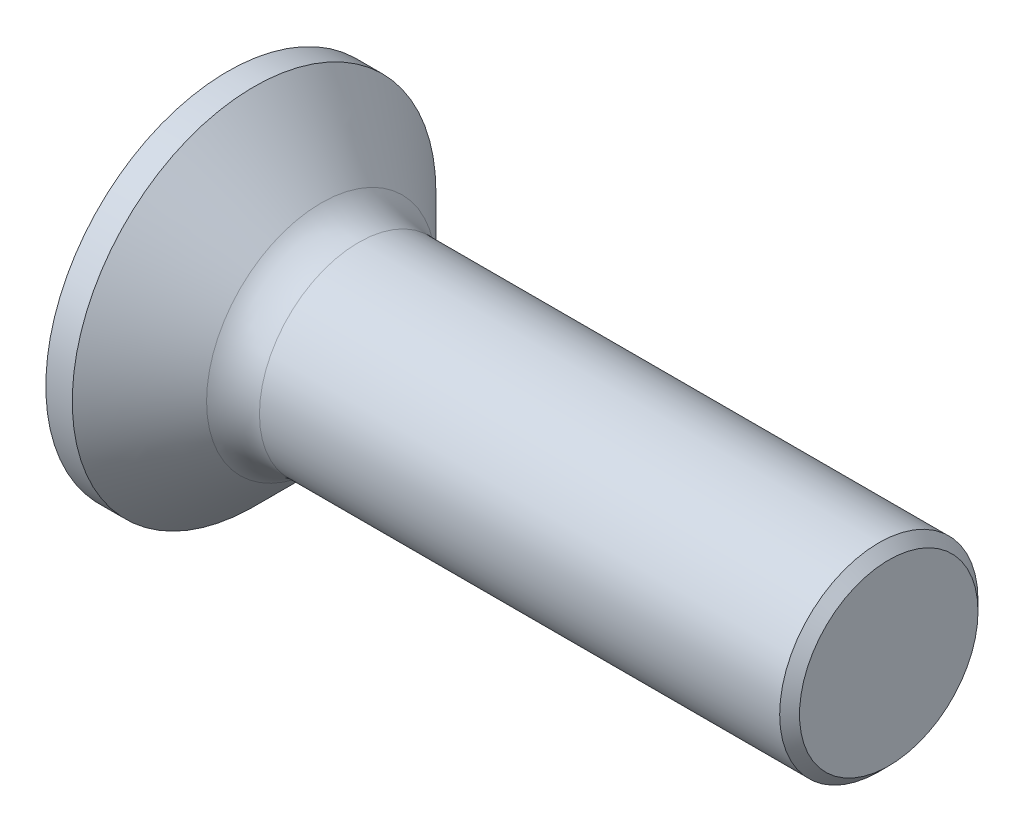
ISO-10303-21;
HEADER;
FILE_DESCRIPTION(('STEP AP214'),'2;1');
FILE_NAME('part.step','',(''),(''),'','','');
FILE_SCHEMA(('AUTOMOTIVE_DESIGN { 1 0 10303 214 1 1 1 1 }'));
ENDSEC;
DATA;
#1=APPLICATION_CONTEXT('core data for automotive mechanical design processes');
#2=APPLICATION_PROTOCOL_DEFINITION('international standard','automotive_design',2000,#1);
#3=PRODUCT_CONTEXT('',#1,'mechanical');
#4=PRODUCT('Part','Part','',(#3));
#5=PRODUCT_RELATED_PRODUCT_CATEGORY('part','',(#4));
#6=PRODUCT_DEFINITION_FORMATION('','',#4);
#7=PRODUCT_DEFINITION_CONTEXT('part definition',#1,'design');
#8=PRODUCT_DEFINITION('design','',#6,#7);
#9=PRODUCT_DEFINITION_SHAPE('','',#8);
#10=(LENGTH_UNIT() NAMED_UNIT(*) SI_UNIT(.MILLI.,.METRE.));
#11=(NAMED_UNIT(*) PLANE_ANGLE_UNIT() SI_UNIT($,.RADIAN.));
#12=(NAMED_UNIT(*) SI_UNIT($,.STERADIAN.) SOLID_ANGLE_UNIT());
#13=UNCERTAINTY_MEASURE_WITH_UNIT(LENGTH_MEASURE(1.E-05),#10,'distance_accuracy_value','');
#14=(GEOMETRIC_REPRESENTATION_CONTEXT(3) GLOBAL_UNCERTAINTY_ASSIGNED_CONTEXT((#13)) GLOBAL_UNIT_ASSIGNED_CONTEXT((#10,
#11,#12)) REPRESENTATION_CONTEXT('',''));
#15=CARTESIAN_POINT('',(0.,0.,0.));
#16=DIRECTION('',(0.,0.,1.));
#17=DIRECTION('',(1.,0.,0.));
#18=AXIS2_PLACEMENT_3D('',#15,#16,#17);
#19=CARTESIAN_POINT('',(0.2,0.,0.));
#20=DIRECTION('',(-1.,0.,0.));
#21=DIRECTION('',(0.,0.,1.));
#22=AXIS2_PLACEMENT_3D('',#19,#20,#21);
#23=CYLINDRICAL_SURFACE('',#22,2.75);
#24=CARTESIAN_POINT('',(0.4,0.,0.));
#25=DIRECTION('',(-1.,0.,0.));
#26=DIRECTION('',(0.,0.,-1.));
#27=AXIS2_PLACEMENT_3D('',#24,#25,#26);
#28=CIRCLE('',#27,2.75);
#29=CARTESIAN_POINT('',(0.4,0.,-2.75));
#30=VERTEX_POINT('',#29);
#31=EDGE_CURVE('E373',#30,#30,#28,.T.);
#32=ORIENTED_EDGE('',*,*,#31,.T.);
#33=EDGE_LOOP('',(#32));
#34=FACE_BOUND('',#33,.T.);
#35=CARTESIAN_POINT('',(0.,0.,0.));
#36=DIRECTION('',(-1.,0.,0.));
#37=DIRECTION('',(0.,0.,-1.));
#38=AXIS2_PLACEMENT_3D('',#35,#36,#37);
#39=CIRCLE('',#38,2.75);
#40=CARTESIAN_POINT('',(0.,0.,-2.75));
#41=VERTEX_POINT('',#40);
#42=EDGE_CURVE('E376',#41,#41,#39,.T.);
#43=ORIENTED_EDGE('',*,*,#42,.F.);
#44=EDGE_LOOP('',(#43));
#45=FACE_BOUND('',#44,.T.);
#46=ADVANCED_FACE('F17',(#34,#45),#23,.T.);
#47=DIRECTION('',(0.707106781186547,0.,0.707106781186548));
#48=VECTOR('',#47,1.);
#49=CARTESIAN_POINT('',(-498996.85,-1.22215714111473E-10,-499000.));
#50=LINE('',#49,#48);
#51=CARTESIAN_POINT('',(3.15,0.,0.));
#52=DIRECTION('',(-1.,0.,0.));
#53=AXIS1_PLACEMENT('',#51,#52);
#54=SURFACE_OF_REVOLUTION('',#50,#53);
#55=CARTESIAN_POINT('',(1.41568542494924,0.,0.));
#56=DIRECTION('',(-1.,0.,0.));
#57=DIRECTION('',(0.,0.,-1.));
#58=AXIS2_PLACEMENT_3D('',#55,#56,#57);
#59=CIRCLE('',#58,1.73431457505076);
#60=CARTESIAN_POINT('',(1.41568542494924,0.,-1.73431457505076));
#61=VERTEX_POINT('',#60);
#62=EDGE_CURVE('E11',#61,#61,#59,.T.);
#63=ORIENTED_EDGE('',*,*,#62,.T.);
#64=EDGE_LOOP('',(#63));
#65=FACE_BOUND('',#64,.T.);
#66=ORIENTED_EDGE('',*,*,#31,.F.);
#67=EDGE_LOOP('',(#66));
#68=FACE_BOUND('',#67,.T.);
#69=ADVANCED_FACE('F233',(#65,#68),#54,.F.);
#70=CARTESIAN_POINT('',(1.98137084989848,0.,0.));
#71=DIRECTION('',(-1.,0.,0.));
#72=DIRECTION('',(0.,0.,1.));
#73=AXIS2_PLACEMENT_3D('',#70,#71,#72);
#74=TOROIDAL_SURFACE('',#73,2.3,0.8);
#75=CARTESIAN_POINT('',(1.98137084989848,0.,0.));
#76=DIRECTION('',(-1.,0.,0.));
#77=DIRECTION('',(0.,0.,-1.));
#78=AXIS2_PLACEMENT_3D('',#75,#76,#77);
#79=CIRCLE('',#78,1.5);
#80=CARTESIAN_POINT('',(1.98137084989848,0.,-1.5));
#81=VERTEX_POINT('',#80);
#82=EDGE_CURVE('E27',#81,#81,#79,.T.);
#83=ORIENTED_EDGE('',*,*,#82,.T.);
#84=EDGE_LOOP('',(#83));
#85=FACE_BOUND('',#84,.T.);
#86=ORIENTED_EDGE('',*,*,#62,.F.);
#87=EDGE_LOOP('',(#86));
#88=FACE_BOUND('',#87,.T.);
#89=ADVANCED_FACE('F237',(#85,#88),#74,.F.);
#90=CARTESIAN_POINT('',(5.91568542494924,0.,0.));
#91=DIRECTION('',(-1.,0.,0.));
#92=DIRECTION('',(0.,0.,1.));
#93=AXIS2_PLACEMENT_3D('',#90,#91,#92);
#94=CYLINDRICAL_SURFACE('',#93,1.5);
#95=CARTESIAN_POINT('',(9.85,0.,0.));
#96=DIRECTION('',(-1.,0.,0.));
#97=DIRECTION('',(0.,0.,-1.));
#98=AXIS2_PLACEMENT_3D('',#95,#96,#97);
#99=CIRCLE('',#98,1.5);
#100=CARTESIAN_POINT('',(9.85,0.,-1.5));
#101=VERTEX_POINT('',#100);
#102=EDGE_CURVE('E408',#101,#101,#99,.T.);
#103=ORIENTED_EDGE('',*,*,#102,.T.);
#104=EDGE_LOOP('',(#103));
#105=FACE_BOUND('',#104,.T.);
#106=ORIENTED_EDGE('',*,*,#82,.F.);
#107=EDGE_LOOP('',(#106));
#108=FACE_BOUND('',#107,.T.);
#109=ADVANCED_FACE('F241',(#105,#108),#94,.T.);
#110=DIRECTION('',(0.707106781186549,0.,0.707106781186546));
#111=VECTOR('',#110,1.);
#112=CARTESIAN_POINT('',(-498988.650000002,-1.22215714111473E-10,-499000.));
#113=LINE('',#112,#111);
#114=CARTESIAN_POINT('',(11.35,0.,0.));
#115=DIRECTION('',(-1.,0.,0.));
#116=AXIS1_PLACEMENT('',#114,#115);
#117=SURFACE_OF_REVOLUTION('',#113,#116);
#118=CARTESIAN_POINT('',(10.,0.,0.));
#119=DIRECTION('',(-1.,0.,0.));
#120=DIRECTION('',(0.,0.,-1.));
#121=AXIS2_PLACEMENT_3D('',#118,#119,#120);
#122=CIRCLE('',#121,1.35);
#123=CARTESIAN_POINT('',(10.,0.,-1.35));
#124=VERTEX_POINT('',#123);
#125=EDGE_CURVE('E411',#124,#124,#122,.T.);
#126=ORIENTED_EDGE('',*,*,#125,.T.);
#127=EDGE_LOOP('',(#126));
#128=FACE_BOUND('',#127,.T.);
#129=ORIENTED_EDGE('',*,*,#102,.F.);
#130=EDGE_LOOP('',(#129));
#131=FACE_BOUND('',#130,.T.);
#132=ADVANCED_FACE('F245',(#128,#131),#117,.F.);
#133=CARTESIAN_POINT('',(10.,0.,-0.674999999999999));
#134=DIRECTION('',(1.,0.,0.));
#135=DIRECTION('',(0.,1.,0.));
#136=AXIS2_PLACEMENT_3D('',#133,#134,#135);
#137=PLANE('',#136);
#138=ORIENTED_EDGE('',*,*,#125,.F.);
#139=EDGE_LOOP('',(#138));
#140=FACE_BOUND('',#139,.T.);
#141=ADVANCED_FACE('F249',(#140),#137,.T.);
#142=CARTESIAN_POINT('',(-1.,-1.7,0.425));
#143=DIRECTION('',(0.,1.,0.));
#144=DIRECTION('',(0.,0.,1.));
#145=AXIS2_PLACEMENT_3D('',#142,#143,#144);
#146=PLANE('',#145);
#147=DIRECTION('',(0.,0.,-1.));
#148=VECTOR('',#147,1.);
#149=CARTESIAN_POINT('',(0.,-1.7,-0.475));
#150=LINE('',#149,#148);
#151=CARTESIAN_POINT('',(0.,-1.7,0.425));
#152=VERTEX_POINT('',#151);
#153=CARTESIAN_POINT('',(0.,-1.7,-0.425));
#154=VERTEX_POINT('',#153);
#155=EDGE_CURVE('E36',#152,#154,#150,.T.);
#156=ORIENTED_EDGE('',*,*,#155,.F.);
#157=DIRECTION('',(1.,0.,0.));
#158=VECTOR('',#157,1.);
#159=CARTESIAN_POINT('',(-1.,-1.7,0.425));
#160=LINE('',#159,#158);
#161=CARTESIAN_POINT('',(0.825,-1.7,0.425));
#162=VERTEX_POINT('',#161);
#163=EDGE_CURVE('E457',#152,#162,#160,.T.);
#164=ORIENTED_EDGE('',*,*,#163,.T.);
#165=DIRECTION('',(0.,0.,-1.));
#166=VECTOR('',#165,1.);
#167=CARTESIAN_POINT('',(0.825,-1.7,0.425));
#168=LINE('',#167,#166);
#169=CARTESIAN_POINT('',(0.825,-1.7,-0.425));
#170=VERTEX_POINT('',#169);
#171=EDGE_CURVE('E415',#162,#170,#168,.T.);
#172=ORIENTED_EDGE('',*,*,#171,.T.);
#173=DIRECTION('',(1.,0.,0.));
#174=VECTOR('',#173,1.);
#175=CARTESIAN_POINT('',(-1.,-1.7,-0.425));
#176=LINE('',#175,#174);
#177=EDGE_CURVE('E477',#154,#170,#176,.T.);
#178=ORIENTED_EDGE('',*,*,#177,.F.);
#179=EDGE_LOOP('',(#156,#164,#172,#178));
#180=FACE_BOUND('',#179,.T.);
#181=ADVANCED_FACE('F253',(#180),#146,.T.);
#182=CARTESIAN_POINT('',(2.5245,0.425,0.425));
#183=DIRECTION('',(-0.600112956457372,-0.799915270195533,0.));
#184=DIRECTION('',(0.799915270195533,-0.600112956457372,0.));
#185=AXIS2_PLACEMENT_3D('',#182,#183,#184);
#186=PLANE('',#185);
#187=DIRECTION('',(-0.799915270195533,0.600112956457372,0.));
#188=VECTOR('',#187,1.);
#189=CARTESIAN_POINT('',(2.5245,0.425,-0.425));
#190=LINE('',#189,#188);
#191=CARTESIAN_POINT('',(2.5245,0.425,-0.425));
#192=VERTEX_POINT('',#191);
#193=CARTESIAN_POINT('',(0.825,1.7,-0.425));
#194=VERTEX_POINT('',#193);
#195=EDGE_CURVE('E422',#192,#194,#190,.T.);
#196=ORIENTED_EDGE('',*,*,#195,.F.);
#197=DIRECTION('',(0.,0.,-1.));
#198=VECTOR('',#197,1.);
#199=CARTESIAN_POINT('',(2.5245,0.425,0.425));
#200=LINE('',#199,#198);
#201=CARTESIAN_POINT('',(2.5245,0.425,0.425));
#202=VERTEX_POINT('',#201);
#203=EDGE_CURVE('E483',#202,#192,#200,.T.);
#204=ORIENTED_EDGE('',*,*,#203,.F.);
#205=DIRECTION('',(-0.799915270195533,0.600112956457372,0.));
#206=VECTOR('',#205,1.);
#207=CARTESIAN_POINT('',(2.5245,0.425,0.425));
#208=LINE('',#207,#206);
#209=CARTESIAN_POINT('',(0.825,1.7,0.425));
#210=VERTEX_POINT('',#209);
#211=EDGE_CURVE('E412',#202,#210,#208,.T.);
#212=ORIENTED_EDGE('',*,*,#211,.T.);
#213=DIRECTION('',(0.,0.,-1.));
#214=VECTOR('',#213,1.);
#215=CARTESIAN_POINT('',(0.825,1.7,0.425));
#216=LINE('',#215,#214);
#217=EDGE_CURVE('E416',#210,#194,#216,.T.);
#218=ORIENTED_EDGE('',*,*,#217,.T.);
#219=EDGE_LOOP('',(#196,#204,#212,#218));
#220=FACE_BOUND('',#219,.T.);
#221=ADVANCED_FACE('F257',(#220),#186,.T.);
#222=CARTESIAN_POINT('',(2.5245,-0.425,0.425));
#223=DIRECTION('',(-1.,0.,0.));
#224=DIRECTION('',(0.,0.,1.));
#225=AXIS2_PLACEMENT_3D('',#222,#223,#224);
#226=PLANE('',#225);
#227=DIRECTION('',(0.,0.,-1.));
#228=VECTOR('',#227,1.);
#229=CARTESIAN_POINT('',(2.5245,-0.419753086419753,0.2125));
#230=LINE('',#229,#228);
#231=CARTESIAN_POINT('',(2.5245,-0.419753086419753,0.425));
#232=VERTEX_POINT('',#231);
#233=CARTESIAN_POINT('',(2.5245,-0.419753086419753,-0.425));
#234=VERTEX_POINT('',#233);
#235=EDGE_CURVE('E219',#232,#234,#230,.T.);
#236=ORIENTED_EDGE('',*,*,#235,.T.);
#237=DIRECTION('',(0.,1.,0.));
#238=VECTOR('',#237,1.);
#239=CARTESIAN_POINT('',(2.5245,-0.425,-0.425));
#240=LINE('',#239,#238);
#241=CARTESIAN_POINT('',(2.5245,-0.425,-0.425));
#242=VERTEX_POINT('',#241);
#243=EDGE_CURVE('E511',#242,#234,#240,.T.);
#244=ORIENTED_EDGE('',*,*,#243,.F.);
#245=DIRECTION('',(0.,0.,-1.));
#246=VECTOR('',#245,1.);
#247=CARTESIAN_POINT('',(2.5245,-0.425,0.425));
#248=LINE('',#247,#246);
#249=CARTESIAN_POINT('',(2.5245,-0.425,0.425));
#250=VERTEX_POINT('',#249);
#251=EDGE_CURVE('E435',#250,#242,#248,.T.);
#252=ORIENTED_EDGE('',*,*,#251,.F.);
#253=DIRECTION('',(0.,1.,0.));
#254=VECTOR('',#253,1.);
#255=CARTESIAN_POINT('',(2.5245,-0.425,0.425));
#256=LINE('',#255,#254);
#257=EDGE_CURVE('E458',#250,#232,#256,.T.);
#258=ORIENTED_EDGE('',*,*,#257,.T.);
#259=EDGE_LOOP('',(#236,#244,#252,#258));
#260=FACE_BOUND('',#259,.T.);
#261=ADVANCED_FACE('F260',(#260),#226,.T.);
#262=CARTESIAN_POINT('',(0.825,-1.7,0.425));
#263=DIRECTION('',(-0.600112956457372,0.799915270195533,0.));
#264=DIRECTION('',(-0.799915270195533,-0.600112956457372,0.));
#265=AXIS2_PLACEMENT_3D('',#262,#263,#264);
#266=PLANE('',#265);
#267=DIRECTION('',(0.799915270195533,0.600112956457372,0.));
#268=VECTOR('',#267,1.);
#269=CARTESIAN_POINT('',(0.825,-1.7,-0.425));
#270=LINE('',#269,#268);
#271=EDGE_CURVE('E480',#170,#242,#270,.T.);
#272=ORIENTED_EDGE('',*,*,#271,.F.);
#273=ORIENTED_EDGE('',*,*,#171,.F.);
#274=DIRECTION('',(0.799915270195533,0.600112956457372,0.));
#275=VECTOR('',#274,1.);
#276=CARTESIAN_POINT('',(0.825,-1.7,0.425));
#277=LINE('',#276,#275);
#278=EDGE_CURVE('E461',#162,#250,#277,.T.);
#279=ORIENTED_EDGE('',*,*,#278,.T.);
#280=ORIENTED_EDGE('',*,*,#251,.T.);
#281=EDGE_LOOP('',(#272,#273,#279,#280));
#282=FACE_BOUND('',#281,.T.);
#283=ADVANCED_FACE('F264',(#282),#266,.T.);
#284=CARTESIAN_POINT('',(0.825,1.7,0.425));
#285=DIRECTION('',(0.,-1.,0.));
#286=DIRECTION('',(0.,0.,-1.));
#287=AXIS2_PLACEMENT_3D('',#284,#285,#286);
#288=PLANE('',#287);
#289=DIRECTION('',(0.,0.,1.));
#290=VECTOR('',#289,1.);
#291=CARTESIAN_POINT('',(0.,1.7,-0.475));
#292=LINE('',#291,#290);
#293=CARTESIAN_POINT('',(0.,1.7,-0.425));
#294=VERTEX_POINT('',#293);
#295=CARTESIAN_POINT('',(0.,1.7,0.425));
#296=VERTEX_POINT('',#295);
#297=EDGE_CURVE('E389',#294,#296,#292,.T.);
#298=ORIENTED_EDGE('',*,*,#297,.F.);
#299=DIRECTION('',(-1.,0.,0.));
#300=VECTOR('',#299,1.);
#301=CARTESIAN_POINT('',(0.825,1.7,-0.425));
#302=LINE('',#301,#300);
#303=EDGE_CURVE('E425',#194,#294,#302,.T.);
#304=ORIENTED_EDGE('',*,*,#303,.F.);
#305=ORIENTED_EDGE('',*,*,#217,.F.);
#306=DIRECTION('',(-1.,0.,0.));
#307=VECTOR('',#306,1.);
#308=CARTESIAN_POINT('',(0.825,1.7,0.425));
#309=LINE('',#308,#307);
#310=EDGE_CURVE('E432',#210,#296,#309,.T.);
#311=ORIENTED_EDGE('',*,*,#310,.T.);
#312=EDGE_LOOP('',(#298,#304,#305,#311));
#313=FACE_BOUND('',#312,.T.);
#314=ADVANCED_FACE('F268',(#313),#288,.T.);
#315=CARTESIAN_POINT('',(0.,0.,0.425));
#316=DIRECTION('',(0.,0.,-1.));
#317=DIRECTION('',(-1.,0.,0.));
#318=AXIS2_PLACEMENT_3D('',#315,#316,#317);
#319=PLANE('',#318);
#320=DIRECTION('',(-1.,0.,0.));
#321=VECTOR('',#320,1.);
#322=CARTESIAN_POINT('',(0.,0.55003270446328,0.425));
#323=LINE('',#322,#321);
#324=CARTESIAN_POINT('',(1.,0.55003270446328,0.425));
#325=VERTEX_POINT('',#324);
#326=CARTESIAN_POINT('',(0.,0.55003270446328,0.425));
#327=VERTEX_POINT('',#326);
#328=EDGE_CURVE('E436',#325,#327,#323,.T.);
#329=ORIENTED_EDGE('',*,*,#328,.T.);
#330=DIRECTION('',(0.,-1.,0.));
#331=VECTOR('',#330,1.);
#332=CARTESIAN_POINT('',(0.,0.,0.425));
#333=LINE('',#332,#331);
#334=EDGE_CURVE('E391',#296,#327,#333,.T.);
#335=ORIENTED_EDGE('',*,*,#334,.F.);
#336=ORIENTED_EDGE('',*,*,#310,.F.);
#337=ORIENTED_EDGE('',*,*,#211,.F.);
#338=DIRECTION('',(0.,1.,0.));
#339=VECTOR('',#338,1.);
#340=CARTESIAN_POINT('',(2.5245,-0.425,0.425));
#341=LINE('',#340,#339);
#342=CARTESIAN_POINT('',(2.5245,0.419753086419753,0.425));
#343=VERTEX_POINT('',#342);
#344=EDGE_CURVE('E495',#343,#202,#341,.T.);
#345=ORIENTED_EDGE('',*,*,#344,.F.);
#346=DIRECTION('',(-1.,0.,0.));
#347=VECTOR('',#346,1.);
#348=CARTESIAN_POINT('',(0.,0.419753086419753,0.425));
#349=LINE('',#348,#347);
#350=CARTESIAN_POINT('',(1.,0.419753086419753,0.425));
#351=VERTEX_POINT('',#350);
#352=EDGE_CURVE('E470',#343,#351,#349,.T.);
#353=ORIENTED_EDGE('',*,*,#352,.T.);
#354=DIRECTION('',(0.,1.,0.));
#355=VECTOR('',#354,1.);
#356=CARTESIAN_POINT('',(1.,0.,0.425));
#357=LINE('',#356,#355);
#358=EDGE_CURVE('E523',#351,#325,#357,.T.);
#359=ORIENTED_EDGE('',*,*,#358,.T.);
#360=EDGE_LOOP('',(#329,#335,#336,#337,#345,#353,#359));
#361=FACE_BOUND('',#360,.T.);
#362=ADVANCED_FACE('F272',(#361),#319,.T.);
#363=CARTESIAN_POINT('',(2.5245,-0.425,0.425));
#364=DIRECTION('',(-1.,0.,0.));
#365=DIRECTION('',(0.,0.,1.));
#366=AXIS2_PLACEMENT_3D('',#363,#364,#365);
#367=PLANE('',#366);
#368=DIRECTION('',(0.,0.,1.));
#369=VECTOR('',#368,1.);
#370=CARTESIAN_POINT('',(2.5245,0.419753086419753,0.2125));
#371=LINE('',#370,#369);
#372=CARTESIAN_POINT('',(2.5245,0.419753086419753,-0.425));
#373=VERTEX_POINT('',#372);
#374=EDGE_CURVE('E497',#373,#343,#371,.T.);
#375=ORIENTED_EDGE('',*,*,#374,.T.);
#376=ORIENTED_EDGE('',*,*,#344,.T.);
#377=ORIENTED_EDGE('',*,*,#203,.T.);
#378=DIRECTION('',(0.,1.,0.));
#379=VECTOR('',#378,1.);
#380=CARTESIAN_POINT('',(2.5245,-0.425,-0.425));
#381=LINE('',#380,#379);
#382=EDGE_CURVE('E424',#373,#192,#381,.T.);
#383=ORIENTED_EDGE('',*,*,#382,.F.);
#384=EDGE_LOOP('',(#375,#376,#377,#383));
#385=FACE_BOUND('',#384,.T.);
#386=ADVANCED_FACE('F276',(#385),#367,.T.);
#387=CARTESIAN_POINT('',(0.,0.,-0.425));
#388=DIRECTION('',(0.,0.,1.));
#389=DIRECTION('',(1.,0.,0.));
#390=AXIS2_PLACEMENT_3D('',#387,#388,#389);
#391=PLANE('',#390);
#392=DIRECTION('',(-1.,0.,0.));
#393=VECTOR('',#392,1.);
#394=CARTESIAN_POINT('',(0.,-0.55003270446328,-0.425));
#395=LINE('',#394,#393);
#396=CARTESIAN_POINT('',(1.,-0.55003270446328,-0.425));
#397=VERTEX_POINT('',#396);
#398=CARTESIAN_POINT('',(0.,-0.55003270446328,-0.425));
#399=VERTEX_POINT('',#398);
#400=EDGE_CURVE('E479',#397,#399,#395,.T.);
#401=ORIENTED_EDGE('',*,*,#400,.T.);
#402=DIRECTION('',(0.,1.,0.));
#403=VECTOR('',#402,1.);
#404=CARTESIAN_POINT('',(0.,0.,-0.425));
#405=LINE('',#404,#403);
#406=EDGE_CURVE('E431',#154,#399,#405,.T.);
#407=ORIENTED_EDGE('',*,*,#406,.F.);
#408=ORIENTED_EDGE('',*,*,#177,.T.);
#409=ORIENTED_EDGE('',*,*,#271,.T.);
#410=ORIENTED_EDGE('',*,*,#243,.T.);
#411=DIRECTION('',(-1.,0.,0.));
#412=VECTOR('',#411,1.);
#413=CARTESIAN_POINT('',(0.,-0.419753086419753,-0.425));
#414=LINE('',#413,#412);
#415=CARTESIAN_POINT('',(1.,-0.419753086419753,-0.425));
#416=VERTEX_POINT('',#415);
#417=EDGE_CURVE('E381',#234,#416,#414,.T.);
#418=ORIENTED_EDGE('',*,*,#417,.T.);
#419=DIRECTION('',(0.,-1.,0.));
#420=VECTOR('',#419,1.);
#421=CARTESIAN_POINT('',(1.,0.,-0.425));
#422=LINE('',#421,#420);
#423=EDGE_CURVE('E377',#416,#397,#422,.T.);
#424=ORIENTED_EDGE('',*,*,#423,.T.);
#425=EDGE_LOOP('',(#401,#407,#408,#409,#410,#418,#424));
#426=FACE_BOUND('',#425,.T.);
#427=ADVANCED_FACE('F280',(#426),#391,.T.);
#428=CARTESIAN_POINT('',(0.,0.,-1.375));
#429=DIRECTION('',(-1.,0.,0.));
#430=DIRECTION('',(0.,0.,1.));
#431=AXIS2_PLACEMENT_3D('',#428,#429,#430);
#432=PLANE('',#431);
#433=ORIENTED_EDGE('',*,*,#42,.T.);
#434=EDGE_LOOP('',(#433));
#435=FACE_BOUND('',#434,.T.);
#436=DIRECTION('',(0.,-0.642787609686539,0.766044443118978));
#437=VECTOR('',#436,1.);
#438=CARTESIAN_POINT('',(0.,0.491985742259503,-0.355822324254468));
#439=LINE('',#438,#437);
#440=CARTESIAN_POINT('',(0.,1.20208152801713,-1.20208152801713));
#441=VERTEX_POINT('',#440);
#442=CARTESIAN_POINT('',(0.,0.55003270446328,-0.425));
#443=VERTEX_POINT('',#442);
#444=EDGE_CURVE('E378',#441,#443,#439,.T.);
#445=ORIENTED_EDGE('',*,*,#444,.T.);
#446=DIRECTION('',(0.,1.,0.));
#447=VECTOR('',#446,1.);
#448=CARTESIAN_POINT('',(0.,0.,-0.425));
#449=LINE('',#448,#447);
#450=EDGE_CURVE('E384',#443,#294,#449,.T.);
#451=ORIENTED_EDGE('',*,*,#450,.T.);
#452=ORIENTED_EDGE('',*,*,#297,.T.);
#453=ORIENTED_EDGE('',*,*,#334,.T.);
#454=DIRECTION('',(0.,0.642787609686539,0.766044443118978));
#455=VECTOR('',#454,1.);
#456=CARTESIAN_POINT('',(0.,0.319263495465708,0.149979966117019));
#457=LINE('',#456,#455);
#458=CARTESIAN_POINT('',(0.,1.20208152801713,1.20208152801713));
#459=VERTEX_POINT('',#458);
#460=EDGE_CURVE('E507',#327,#459,#457,.T.);
#461=ORIENTED_EDGE('',*,*,#460,.T.);
#462=DIRECTION('',(0.,-0.766044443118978,-0.642787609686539));
#463=VECTOR('',#462,1.);
#464=CARTESIAN_POINT('',(0.,-0.386146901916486,-0.130600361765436));
#465=LINE('',#464,#463);
#466=CARTESIAN_POINT('',(0.,0.419753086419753,0.545630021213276));
#467=VERTEX_POINT('',#466);
#468=EDGE_CURVE('E505',#459,#467,#465,.T.);
#469=ORIENTED_EDGE('',*,*,#468,.T.);
#470=DIRECTION('',(0.,0.,1.));
#471=VECTOR('',#470,1.);
#472=CARTESIAN_POINT('',(0.,0.419753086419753,-0.6875));
#473=LINE('',#472,#471);
#474=CARTESIAN_POINT('',(0.,0.419753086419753,1.7));
#475=VERTEX_POINT('',#474);
#476=EDGE_CURVE('E508',#467,#475,#473,.T.);
#477=ORIENTED_EDGE('',*,*,#476,.T.);
#478=DIRECTION('',(0.,-1.,0.));
#479=VECTOR('',#478,1.);
#480=CARTESIAN_POINT('',(0.,0.209876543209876,1.7));
#481=LINE('',#480,#479);
#482=CARTESIAN_POINT('',(0.,-0.419753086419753,1.7));
#483=VERTEX_POINT('',#482);
#484=EDGE_CURVE('E515',#475,#483,#481,.T.);
#485=ORIENTED_EDGE('',*,*,#484,.T.);
#486=DIRECTION('',(0.,0.,-1.));
#487=VECTOR('',#486,1.);
#488=CARTESIAN_POINT('',(0.,-0.419753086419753,-0.6875));
#489=LINE('',#488,#487);
#490=CARTESIAN_POINT('',(0.,-0.419753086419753,0.545630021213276));
#491=VERTEX_POINT('',#490);
#492=EDGE_CURVE('E518',#483,#491,#489,.T.);
#493=ORIENTED_EDGE('',*,*,#492,.T.);
#494=DIRECTION('',(0.,-0.766044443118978,0.642787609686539));
#495=VECTOR('',#494,1.);
#496=CARTESIAN_POINT('',(0.,-0.214893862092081,0.373732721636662));
#497=LINE('',#496,#495);
#498=CARTESIAN_POINT('',(0.,-1.20208152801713,1.20208152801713));
#499=VERTEX_POINT('',#498);
#500=EDGE_CURVE('E532',#491,#499,#497,.T.);
#501=ORIENTED_EDGE('',*,*,#500,.T.);
#502=DIRECTION('',(0.,0.642787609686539,-0.766044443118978));
#503=VECTOR('',#502,1.);
#504=CARTESIAN_POINT('',(0.,0.18506958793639,-0.451060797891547));
#505=LINE('',#504,#503);
#506=CARTESIAN_POINT('',(0.,-0.55003270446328,0.425));
#507=VERTEX_POINT('',#506);
#508=EDGE_CURVE('E529',#499,#507,#505,.T.);
#509=ORIENTED_EDGE('',*,*,#508,.T.);
#510=DIRECTION('',(0.,-1.,0.));
#511=VECTOR('',#510,1.);
#512=CARTESIAN_POINT('',(0.,0.,0.425));
#513=LINE('',#512,#511);
#514=EDGE_CURVE('E499',#507,#152,#513,.T.);
#515=ORIENTED_EDGE('',*,*,#514,.T.);
#516=ORIENTED_EDGE('',*,*,#155,.T.);
#517=ORIENTED_EDGE('',*,*,#406,.T.);
#518=DIRECTION('',(0.,-0.642787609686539,-0.766044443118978));
#519=VECTOR('',#518,1.);
#520=CARTESIAN_POINT('',(0.,-0.996318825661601,-0.956863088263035));
#521=LINE('',#520,#519);
#522=CARTESIAN_POINT('',(0.,-1.20208152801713,-1.20208152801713));
#523=VERTEX_POINT('',#522);
#524=EDGE_CURVE('E428',#399,#523,#521,.T.);
#525=ORIENTED_EDGE('',*,*,#524,.T.);
#526=DIRECTION('',(0.,0.766044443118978,0.642787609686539));
#527=VECTOR('',#526,1.);
#528=CARTESIAN_POINT('',(0.,-0.290908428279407,-0.437516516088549));
#529=LINE('',#528,#527);
#530=CARTESIAN_POINT('',(0.,-0.419753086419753,-0.545630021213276));
#531=VERTEX_POINT('',#530);
#532=EDGE_CURVE('E419',#523,#531,#529,.T.);
#533=ORIENTED_EDGE('',*,*,#532,.T.);
#534=DIRECTION('',(0.,0.,-1.));
#535=VECTOR('',#534,1.);
#536=CARTESIAN_POINT('',(0.,-0.419753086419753,-0.6875));
#537=LINE('',#536,#535);
#538=CARTESIAN_POINT('',(0.,-0.419753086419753,-1.7));
#539=VERTEX_POINT('',#538);
#540=EDGE_CURVE('E417',#531,#539,#537,.T.);
#541=ORIENTED_EDGE('',*,*,#540,.T.);
#542=DIRECTION('',(0.,1.,0.));
#543=VECTOR('',#542,1.);
#544=CARTESIAN_POINT('',(0.,0.209876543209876,-1.7));
#545=LINE('',#544,#543);
#546=CARTESIAN_POINT('',(0.,0.419753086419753,-1.7));
#547=VERTEX_POINT('',#546);
#548=EDGE_CURVE('E420',#539,#547,#545,.T.);
#549=ORIENTED_EDGE('',*,*,#548,.T.);
#550=DIRECTION('',(0.,0.,1.));
#551=VECTOR('',#550,1.);
#552=CARTESIAN_POINT('',(0.,0.419753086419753,-0.6875));
#553=LINE('',#552,#551);
#554=CARTESIAN_POINT('',(0.,0.419753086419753,-0.545630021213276));
#555=VERTEX_POINT('',#554);
#556=EDGE_CURVE('E398',#547,#555,#553,.T.);
#557=ORIENTED_EDGE('',*,*,#556,.T.);
#558=DIRECTION('',(0.,0.766044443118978,-0.642787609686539));
#559=VECTOR('',#558,1.);
#560=CARTESIAN_POINT('',(0.,0.891949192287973,-0.941849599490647));
#561=LINE('',#560,#559);
#562=EDGE_CURVE('E395',#555,#441,#561,.T.);
#563=ORIENTED_EDGE('',*,*,#562,.T.);
#564=EDGE_LOOP('',(#445,#451,#452,#453,#461,#469,#477,#485,#493,#501,#509,#515,#516,#517,#525,
#533,#541,#549,#557,#563));
#565=FACE_BOUND('',#564,.T.);
#566=ADVANCED_FACE('F284',(#435,#565),#432,.T.);
#567=CARTESIAN_POINT('',(0.,-0.419753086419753,0.));
#568=DIRECTION('',(0.,1.,0.));
#569=DIRECTION('',(0.,0.,1.));
#570=AXIS2_PLACEMENT_3D('',#567,#568,#569);
#571=PLANE('',#570);
#572=DIRECTION('',(0.,0.,1.));
#573=VECTOR('',#572,1.);
#574=CARTESIAN_POINT('',(1.,-0.419753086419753,0.));
#575=LINE('',#574,#573);
#576=CARTESIAN_POINT('',(1.,-0.419753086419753,-0.545630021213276));
#577=VERTEX_POINT('',#576);
#578=EDGE_CURVE('E399',#577,#416,#575,.T.);
#579=ORIENTED_EDGE('',*,*,#578,.T.);
#580=ORIENTED_EDGE('',*,*,#417,.F.);
#581=ORIENTED_EDGE('',*,*,#235,.F.);
#582=DIRECTION('',(1.,0.,0.));
#583=VECTOR('',#582,1.);
#584=CARTESIAN_POINT('',(0.,-0.419753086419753,0.425));
#585=LINE('',#584,#583);
#586=CARTESIAN_POINT('',(1.,-0.419753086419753,0.425));
#587=VERTEX_POINT('',#586);
#588=EDGE_CURVE('E467',#587,#232,#585,.T.);
#589=ORIENTED_EDGE('',*,*,#588,.F.);
#590=DIRECTION('',(0.,0.,1.));
#591=VECTOR('',#590,1.);
#592=CARTESIAN_POINT('',(1.,-0.419753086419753,0.));
#593=LINE('',#592,#591);
#594=CARTESIAN_POINT('',(1.,-0.419753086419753,0.545630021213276));
#595=VERTEX_POINT('',#594);
#596=EDGE_CURVE('E445',#587,#595,#593,.T.);
#597=ORIENTED_EDGE('',*,*,#596,.T.);
#598=DIRECTION('',(-1.,0.,0.));
#599=VECTOR('',#598,1.);
#600=CARTESIAN_POINT('',(0.,-0.419753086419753,0.545630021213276));
#601=LINE('',#600,#599);
#602=EDGE_CURVE('E440',#595,#491,#601,.T.);
#603=ORIENTED_EDGE('',*,*,#602,.T.);
#604=ORIENTED_EDGE('',*,*,#492,.F.);
#605=DIRECTION('',(1.,0.,0.));
#606=VECTOR('',#605,1.);
#607=CARTESIAN_POINT('',(-1.,-0.419753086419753,1.7));
#608=LINE('',#607,#606);
#609=CARTESIAN_POINT('',(0.825,-0.419753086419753,1.7));
#610=VERTEX_POINT('',#609);
#611=EDGE_CURVE('E437',#483,#610,#608,.T.);
#612=ORIENTED_EDGE('',*,*,#611,.T.);
#613=DIRECTION('',(0.802769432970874,0.,-0.596289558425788));
#614=VECTOR('',#613,1.);
#615=CARTESIAN_POINT('',(0.825,-0.419753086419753,1.7));
#616=LINE('',#615,#614);
#617=CARTESIAN_POINT('',(2.5415,-0.419753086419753,0.425));
#618=VERTEX_POINT('',#617);
#619=EDGE_CURVE('E393',#610,#618,#616,.T.);
#620=ORIENTED_EDGE('',*,*,#619,.T.);
#621=DIRECTION('',(0.,0.,-1.));
#622=VECTOR('',#621,1.);
#623=CARTESIAN_POINT('',(2.5415,-0.419753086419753,0.425));
#624=LINE('',#623,#622);
#625=CARTESIAN_POINT('',(2.5415,-0.419753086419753,-0.425));
#626=VERTEX_POINT('',#625);
#627=EDGE_CURVE('E195',#618,#626,#624,.T.);
#628=ORIENTED_EDGE('',*,*,#627,.T.);
#629=DIRECTION('',(-0.802769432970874,0.,-0.596289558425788));
#630=VECTOR('',#629,1.);
#631=CARTESIAN_POINT('',(2.5415,-0.419753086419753,-0.425));
#632=LINE('',#631,#630);
#633=CARTESIAN_POINT('',(0.825,-0.419753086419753,-1.7));
#634=VERTEX_POINT('',#633);
#635=EDGE_CURVE('E394',#626,#634,#632,.T.);
#636=ORIENTED_EDGE('',*,*,#635,.T.);
#637=DIRECTION('',(-1.,0.,0.));
#638=VECTOR('',#637,1.);
#639=CARTESIAN_POINT('',(0.825,-0.419753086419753,-1.7));
#640=LINE('',#639,#638);
#641=EDGE_CURVE('E449',#634,#539,#640,.T.);
#642=ORIENTED_EDGE('',*,*,#641,.T.);
#643=ORIENTED_EDGE('',*,*,#540,.F.);
#644=DIRECTION('',(1.,0.,0.));
#645=VECTOR('',#644,1.);
#646=CARTESIAN_POINT('',(0.,-0.419753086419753,-0.545630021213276));
#647=LINE('',#646,#645);
#648=EDGE_CURVE('E446',#531,#577,#647,.T.);
#649=ORIENTED_EDGE('',*,*,#648,.T.);
#650=EDGE_LOOP('',(#579,#580,#581,#589,#597,#603,#604,#612,#620,#628,#636,#642,#643,#649));
#651=FACE_BOUND('',#650,.T.);
#652=ADVANCED_FACE('F288',(#651),#571,.T.);
#653=CARTESIAN_POINT('',(-1.,0.419753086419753,1.7));
#654=DIRECTION('',(0.,0.,-1.));
#655=DIRECTION('',(-1.,0.,0.));
#656=AXIS2_PLACEMENT_3D('',#653,#654,#655);
#657=PLANE('',#656);
#658=ORIENTED_EDGE('',*,*,#484,.F.);
#659=DIRECTION('',(1.,0.,0.));
#660=VECTOR('',#659,1.);
#661=CARTESIAN_POINT('',(-1.,0.419753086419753,1.7));
#662=LINE('',#661,#660);
#663=CARTESIAN_POINT('',(0.825,0.419753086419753,1.7));
#664=VERTEX_POINT('',#663);
#665=EDGE_CURVE('E151',#475,#664,#662,.T.);
#666=ORIENTED_EDGE('',*,*,#665,.T.);
#667=DIRECTION('',(0.,-1.,0.));
#668=VECTOR('',#667,1.);
#669=CARTESIAN_POINT('',(0.825,0.419753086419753,1.7));
#670=LINE('',#669,#668);
#671=EDGE_CURVE('E204',#664,#610,#670,.T.);
#672=ORIENTED_EDGE('',*,*,#671,.T.);
#673=ORIENTED_EDGE('',*,*,#611,.F.);
#674=EDGE_LOOP('',(#658,#666,#672,#673));
#675=FACE_BOUND('',#674,.T.);
#676=ADVANCED_FACE('F292',(#675),#657,.T.);
#677=CARTESIAN_POINT('',(2.5415,0.419753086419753,-0.425));
#678=DIRECTION('',(-0.596289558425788,0.,0.802769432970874));
#679=DIRECTION('',(0.802769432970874,0.,0.596289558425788));
#680=AXIS2_PLACEMENT_3D('',#677,#678,#679);
#681=PLANE('',#680);
#682=ORIENTED_EDGE('',*,*,#635,.F.);
#683=DIRECTION('',(0.,-1.,0.));
#684=VECTOR('',#683,1.);
#685=CARTESIAN_POINT('',(2.5415,0.419753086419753,-0.425));
#686=LINE('',#685,#684);
#687=CARTESIAN_POINT('',(2.5415,0.419753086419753,-0.425));
#688=VERTEX_POINT('',#687);
#689=EDGE_CURVE('E205',#688,#626,#686,.T.);
#690=ORIENTED_EDGE('',*,*,#689,.F.);
#691=DIRECTION('',(-0.802769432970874,0.,-0.596289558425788));
#692=VECTOR('',#691,1.);
#693=CARTESIAN_POINT('',(2.5415,0.419753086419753,-0.425));
#694=LINE('',#693,#692);
#695=CARTESIAN_POINT('',(0.825,0.419753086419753,-1.7));
#696=VERTEX_POINT('',#695);
#697=EDGE_CURVE('E211',#688,#696,#694,.T.);
#698=ORIENTED_EDGE('',*,*,#697,.T.);
#699=DIRECTION('',(0.,-1.,0.));
#700=VECTOR('',#699,1.);
#701=CARTESIAN_POINT('',(0.825,0.419753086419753,-1.7));
#702=LINE('',#701,#700);
#703=EDGE_CURVE('E212',#696,#634,#702,.T.);
#704=ORIENTED_EDGE('',*,*,#703,.T.);
#705=EDGE_LOOP('',(#682,#690,#698,#704));
#706=FACE_BOUND('',#705,.T.);
#707=ADVANCED_FACE('F296',(#706),#681,.T.);
#708=CARTESIAN_POINT('',(2.5415,0.419753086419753,0.425));
#709=DIRECTION('',(-1.,0.,0.));
#710=DIRECTION('',(0.,0.,1.));
#711=AXIS2_PLACEMENT_3D('',#708,#709,#710);
#712=PLANE('',#711);
#713=ORIENTED_EDGE('',*,*,#627,.F.);
#714=DIRECTION('',(0.,-1.,0.));
#715=VECTOR('',#714,1.);
#716=CARTESIAN_POINT('',(2.5415,0.419753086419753,0.425));
#717=LINE('',#716,#715);
#718=CARTESIAN_POINT('',(2.5415,0.419753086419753,0.425));
#719=VERTEX_POINT('',#718);
#720=EDGE_CURVE('E189',#719,#618,#717,.T.);
#721=ORIENTED_EDGE('',*,*,#720,.F.);
#722=DIRECTION('',(0.,0.,-1.));
#723=VECTOR('',#722,1.);
#724=CARTESIAN_POINT('',(2.5415,0.419753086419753,0.425));
#725=LINE('',#724,#723);
#726=EDGE_CURVE('E193',#719,#688,#725,.T.);
#727=ORIENTED_EDGE('',*,*,#726,.T.);
#728=ORIENTED_EDGE('',*,*,#689,.T.);
#729=EDGE_LOOP('',(#713,#721,#727,#728));
#730=FACE_BOUND('',#729,.T.);
#731=ADVANCED_FACE('F191',(#730),#712,.T.);
#732=CARTESIAN_POINT('',(0.825,0.419753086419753,1.7));
#733=DIRECTION('',(-0.596289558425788,0.,-0.802769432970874));
#734=DIRECTION('',(-0.802769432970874,0.,0.596289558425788));
#735=AXIS2_PLACEMENT_3D('',#732,#733,#734);
#736=PLANE('',#735);
#737=ORIENTED_EDGE('',*,*,#619,.F.);
#738=ORIENTED_EDGE('',*,*,#671,.F.);
#739=DIRECTION('',(0.802769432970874,0.,-0.596289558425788));
#740=VECTOR('',#739,1.);
#741=CARTESIAN_POINT('',(0.825,0.419753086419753,1.7));
#742=LINE('',#741,#740);
#743=EDGE_CURVE('E199',#664,#719,#742,.T.);
#744=ORIENTED_EDGE('',*,*,#743,.T.);
#745=ORIENTED_EDGE('',*,*,#720,.T.);
#746=EDGE_LOOP('',(#737,#738,#744,#745));
#747=FACE_BOUND('',#746,.T.);
#748=ADVANCED_FACE('F203',(#747),#736,.T.);
#749=CARTESIAN_POINT('',(0.825,0.419753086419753,-1.7));
#750=DIRECTION('',(0.,0.,1.));
#751=DIRECTION('',(1.,0.,0.));
#752=AXIS2_PLACEMENT_3D('',#749,#750,#751);
#753=PLANE('',#752);
#754=ORIENTED_EDGE('',*,*,#548,.F.);
#755=ORIENTED_EDGE('',*,*,#641,.F.);
#756=ORIENTED_EDGE('',*,*,#703,.F.);
#757=DIRECTION('',(-1.,0.,0.));
#758=VECTOR('',#757,1.);
#759=CARTESIAN_POINT('',(0.825,0.419753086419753,-1.7));
#760=LINE('',#759,#758);
#761=EDGE_CURVE('E200',#696,#547,#760,.T.);
#762=ORIENTED_EDGE('',*,*,#761,.T.);
#763=EDGE_LOOP('',(#754,#755,#756,#762));
#764=FACE_BOUND('',#763,.T.);
#765=ADVANCED_FACE('F305',(#764),#753,.T.);
#766=CARTESIAN_POINT('',(0.,0.419753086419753,0.));
#767=DIRECTION('',(0.,-1.,0.));
#768=DIRECTION('',(0.,0.,-1.));
#769=AXIS2_PLACEMENT_3D('',#766,#767,#768);
#770=PLANE('',#769);
#771=DIRECTION('',(0.,0.,-1.));
#772=VECTOR('',#771,1.);
#773=CARTESIAN_POINT('',(1.,0.419753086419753,0.));
#774=LINE('',#773,#772);
#775=CARTESIAN_POINT('',(1.,0.419753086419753,-0.425));
#776=VERTEX_POINT('',#775);
#777=CARTESIAN_POINT('',(1.,0.419753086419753,-0.545630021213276));
#778=VERTEX_POINT('',#777);
#779=EDGE_CURVE('E400',#776,#778,#774,.T.);
#780=ORIENTED_EDGE('',*,*,#779,.T.);
#781=DIRECTION('',(-1.,0.,0.));
#782=VECTOR('',#781,1.);
#783=CARTESIAN_POINT('',(0.,0.419753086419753,-0.545630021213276));
#784=LINE('',#783,#782);
#785=EDGE_CURVE('E402',#778,#555,#784,.T.);
#786=ORIENTED_EDGE('',*,*,#785,.T.);
#787=ORIENTED_EDGE('',*,*,#556,.F.);
#788=ORIENTED_EDGE('',*,*,#761,.F.);
#789=ORIENTED_EDGE('',*,*,#697,.F.);
#790=ORIENTED_EDGE('',*,*,#726,.F.);
#791=ORIENTED_EDGE('',*,*,#743,.F.);
#792=ORIENTED_EDGE('',*,*,#665,.F.);
#793=ORIENTED_EDGE('',*,*,#476,.F.);
#794=DIRECTION('',(1.,0.,0.));
#795=VECTOR('',#794,1.);
#796=CARTESIAN_POINT('',(0.,0.419753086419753,0.545630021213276));
#797=LINE('',#796,#795);
#798=CARTESIAN_POINT('',(1.,0.419753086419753,0.545630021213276));
#799=VERTEX_POINT('',#798);
#800=EDGE_CURVE('E141',#467,#799,#797,.T.);
#801=ORIENTED_EDGE('',*,*,#800,.T.);
#802=DIRECTION('',(0.,0.,-1.));
#803=VECTOR('',#802,1.);
#804=CARTESIAN_POINT('',(1.,0.419753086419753,0.));
#805=LINE('',#804,#803);
#806=EDGE_CURVE('E427',#799,#351,#805,.T.);
#807=ORIENTED_EDGE('',*,*,#806,.T.);
#808=ORIENTED_EDGE('',*,*,#352,.F.);
#809=ORIENTED_EDGE('',*,*,#374,.F.);
#810=DIRECTION('',(1.,0.,0.));
#811=VECTOR('',#810,1.);
#812=CARTESIAN_POINT('',(0.,0.419753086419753,-0.425));
#813=LINE('',#812,#811);
#814=EDGE_CURVE('E489',#776,#373,#813,.T.);
#815=ORIENTED_EDGE('',*,*,#814,.F.);
#816=EDGE_LOOP('',(#780,#786,#787,#788,#789,#790,#791,#792,#793,#801,#807,#808,#809,#815));
#817=FACE_BOUND('',#816,.T.);
#818=ADVANCED_FACE('F209',(#817),#770,.T.);
#819=CARTESIAN_POINT('',(0.,0.,0.425));
#820=DIRECTION('',(0.,0.,-1.));
#821=DIRECTION('',(-1.,0.,0.));
#822=AXIS2_PLACEMENT_3D('',#819,#820,#821);
#823=PLANE('',#822);
#824=DIRECTION('',(1.,0.,0.));
#825=VECTOR('',#824,1.);
#826=CARTESIAN_POINT('',(0.,-0.55003270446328,0.425));
#827=LINE('',#826,#825);
#828=CARTESIAN_POINT('',(1.,-0.55003270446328,0.425));
#829=VERTEX_POINT('',#828);
#830=EDGE_CURVE('E466',#507,#829,#827,.T.);
#831=ORIENTED_EDGE('',*,*,#830,.T.);
#832=DIRECTION('',(0.,1.,0.));
#833=VECTOR('',#832,1.);
#834=CARTESIAN_POINT('',(1.,0.,0.425));
#835=LINE('',#834,#833);
#836=EDGE_CURVE('E463',#829,#587,#835,.T.);
#837=ORIENTED_EDGE('',*,*,#836,.T.);
#838=ORIENTED_EDGE('',*,*,#588,.T.);
#839=ORIENTED_EDGE('',*,*,#257,.F.);
#840=ORIENTED_EDGE('',*,*,#278,.F.);
#841=ORIENTED_EDGE('',*,*,#163,.F.);
#842=ORIENTED_EDGE('',*,*,#514,.F.);
#843=EDGE_LOOP('',(#831,#837,#838,#839,#840,#841,#842));
#844=FACE_BOUND('',#843,.T.);
#845=ADVANCED_FACE('F311',(#844),#823,.T.);
#846=CARTESIAN_POINT('',(0.,0.,-0.425));
#847=DIRECTION('',(0.,0.,1.));
#848=DIRECTION('',(1.,0.,0.));
#849=AXIS2_PLACEMENT_3D('',#846,#847,#848);
#850=PLANE('',#849);
#851=DIRECTION('',(1.,0.,0.));
#852=VECTOR('',#851,1.);
#853=CARTESIAN_POINT('',(0.,0.55003270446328,-0.425));
#854=LINE('',#853,#852);
#855=CARTESIAN_POINT('',(1.,0.55003270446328,-0.425));
#856=VERTEX_POINT('',#855);
#857=EDGE_CURVE('E486',#443,#856,#854,.T.);
#858=ORIENTED_EDGE('',*,*,#857,.T.);
#859=DIRECTION('',(0.,-1.,0.));
#860=VECTOR('',#859,1.);
#861=CARTESIAN_POINT('',(1.,0.,-0.425));
#862=LINE('',#861,#860);
#863=EDGE_CURVE('E504',#856,#776,#862,.T.);
#864=ORIENTED_EDGE('',*,*,#863,.T.);
#865=ORIENTED_EDGE('',*,*,#814,.T.);
#866=ORIENTED_EDGE('',*,*,#382,.T.);
#867=ORIENTED_EDGE('',*,*,#195,.T.);
#868=ORIENTED_EDGE('',*,*,#303,.T.);
#869=ORIENTED_EDGE('',*,*,#450,.F.);
#870=EDGE_LOOP('',(#858,#864,#865,#866,#867,#868,#869));
#871=FACE_BOUND('',#870,.T.);
#872=ADVANCED_FACE('F314',(#871),#850,.T.);
#873=CARTESIAN_POINT('',(0.,0.,0.193415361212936));
#874=DIRECTION('',(0.,0.642787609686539,-0.766044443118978));
#875=DIRECTION('',(0.,0.766044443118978,0.642787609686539));
#876=AXIS2_PLACEMENT_3D('',#873,#874,#875);
#877=PLANE('',#876);
#878=ORIENTED_EDGE('',*,*,#800,.F.);
#879=ORIENTED_EDGE('',*,*,#468,.F.);
#880=DIRECTION('',(1.,0.,0.));
#881=VECTOR('',#880,1.);
#882=CARTESIAN_POINT('',(0.,1.20208152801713,1.20208152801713));
#883=LINE('',#882,#881);
#884=CARTESIAN_POINT('',(1.,1.20208152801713,1.20208152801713));
#885=VERTEX_POINT('',#884);
#886=EDGE_CURVE('E450',#459,#885,#883,.T.);
#887=ORIENTED_EDGE('',*,*,#886,.T.);
#888=DIRECTION('',(0.,0.766044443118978,0.642787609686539));
#889=VECTOR('',#888,1.);
#890=CARTESIAN_POINT('',(1.,0.,0.193415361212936));
#891=LINE('',#890,#889);
#892=EDGE_CURVE('E454',#799,#885,#891,.T.);
#893=ORIENTED_EDGE('',*,*,#892,.F.);
#894=EDGE_LOOP('',(#878,#879,#887,#893));
#895=FACE_BOUND('',#894,.T.);
#896=ADVANCED_FACE('F318',(#895),#877,.T.);
#897=CARTESIAN_POINT('',(0.,-1.20208152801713,1.20208152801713));
#898=DIRECTION('',(0.,-0.642787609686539,-0.766044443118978));
#899=DIRECTION('',(0.,0.766044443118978,-0.642787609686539));
#900=AXIS2_PLACEMENT_3D('',#897,#898,#899);
#901=PLANE('',#900);
#902=ORIENTED_EDGE('',*,*,#602,.F.);
#903=DIRECTION('',(0.,0.766044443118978,-0.642787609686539));
#904=VECTOR('',#903,1.);
#905=CARTESIAN_POINT('',(1.,-1.20208152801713,1.20208152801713));
#906=LINE('',#905,#904);
#907=CARTESIAN_POINT('',(1.,-1.20208152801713,1.20208152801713));
#908=VERTEX_POINT('',#907);
#909=EDGE_CURVE('E224',#908,#595,#906,.T.);
#910=ORIENTED_EDGE('',*,*,#909,.F.);
#911=DIRECTION('',(1.,0.,0.));
#912=VECTOR('',#911,1.);
#913=CARTESIAN_POINT('',(0.,-1.20208152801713,1.20208152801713));
#914=LINE('',#913,#912);
#915=EDGE_CURVE('E510',#499,#908,#914,.T.);
#916=ORIENTED_EDGE('',*,*,#915,.F.);
#917=ORIENTED_EDGE('',*,*,#500,.F.);
#918=EDGE_LOOP('',(#902,#910,#916,#917));
#919=FACE_BOUND('',#918,.T.);
#920=ADVANCED_FACE('F322',(#919),#901,.T.);
#921=CARTESIAN_POINT('',(0.,0.,-0.193415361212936));
#922=DIRECTION('',(0.,-0.642787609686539,0.766044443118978));
#923=DIRECTION('',(0.,-0.766044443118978,-0.642787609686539));
#924=AXIS2_PLACEMENT_3D('',#921,#922,#923);
#925=PLANE('',#924);
#926=ORIENTED_EDGE('',*,*,#648,.F.);
#927=ORIENTED_EDGE('',*,*,#532,.F.);
#928=DIRECTION('',(1.,0.,0.));
#929=VECTOR('',#928,1.);
#930=CARTESIAN_POINT('',(0.,-1.20208152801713,-1.20208152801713));
#931=LINE('',#930,#929);
#932=CARTESIAN_POINT('',(1.,-1.20208152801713,-1.20208152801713));
#933=VERTEX_POINT('',#932);
#934=EDGE_CURVE('E406',#523,#933,#931,.T.);
#935=ORIENTED_EDGE('',*,*,#934,.T.);
#936=DIRECTION('',(0.,-0.766044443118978,-0.642787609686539));
#937=VECTOR('',#936,1.);
#938=CARTESIAN_POINT('',(1.,0.,-0.193415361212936));
#939=LINE('',#938,#937);
#940=EDGE_CURVE('E221',#577,#933,#939,.T.);
#941=ORIENTED_EDGE('',*,*,#940,.F.);
#942=EDGE_LOOP('',(#926,#927,#935,#941));
#943=FACE_BOUND('',#942,.T.);
#944=ADVANCED_FACE('F325',(#943),#925,.T.);
#945=CARTESIAN_POINT('',(0.,1.20208152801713,-1.20208152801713));
#946=DIRECTION('',(0.,0.642787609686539,0.766044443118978));
#947=DIRECTION('',(0.,-0.766044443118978,0.642787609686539));
#948=AXIS2_PLACEMENT_3D('',#945,#946,#947);
#949=PLANE('',#948);
#950=ORIENTED_EDGE('',*,*,#785,.F.);
#951=DIRECTION('',(0.,-0.766044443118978,0.642787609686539));
#952=VECTOR('',#951,1.);
#953=CARTESIAN_POINT('',(1.,1.20208152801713,-1.20208152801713));
#954=LINE('',#953,#952);
#955=CARTESIAN_POINT('',(1.,1.20208152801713,-1.20208152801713));
#956=VERTEX_POINT('',#955);
#957=EDGE_CURVE('E407',#956,#778,#954,.T.);
#958=ORIENTED_EDGE('',*,*,#957,.F.);
#959=DIRECTION('',(1.,0.,0.));
#960=VECTOR('',#959,1.);
#961=CARTESIAN_POINT('',(0.,1.20208152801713,-1.20208152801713));
#962=LINE('',#961,#960);
#963=EDGE_CURVE('E473',#441,#956,#962,.T.);
#964=ORIENTED_EDGE('',*,*,#963,.F.);
#965=ORIENTED_EDGE('',*,*,#562,.F.);
#966=EDGE_LOOP('',(#950,#958,#964,#965));
#967=FACE_BOUND('',#966,.T.);
#968=ADVANCED_FACE('F329',(#967),#949,.T.);
#969=CARTESIAN_POINT('',(1.,0.,0.));
#970=DIRECTION('',(-1.,0.,0.));
#971=DIRECTION('',(0.,0.,1.));
#972=AXIS2_PLACEMENT_3D('',#969,#970,#971);
#973=PLANE('',#972);
#974=ORIENTED_EDGE('',*,*,#863,.F.);
#975=DIRECTION('',(0.,0.642787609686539,-0.766044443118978));
#976=VECTOR('',#975,1.);
#977=CARTESIAN_POINT('',(1.,0.193415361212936,0.));
#978=LINE('',#977,#976);
#979=EDGE_CURVE('E403',#856,#956,#978,.T.);
#980=ORIENTED_EDGE('',*,*,#979,.T.);
#981=ORIENTED_EDGE('',*,*,#957,.T.);
#982=ORIENTED_EDGE('',*,*,#779,.F.);
#983=EDGE_LOOP('',(#974,#980,#981,#982));
#984=FACE_BOUND('',#983,.T.);
#985=ADVANCED_FACE('F333',(#984),#973,.T.);
#986=CARTESIAN_POINT('',(1.,0.,0.));
#987=DIRECTION('',(-1.,0.,0.));
#988=DIRECTION('',(0.,0.,1.));
#989=AXIS2_PLACEMENT_3D('',#986,#987,#988);
#990=PLANE('',#989);
#991=ORIENTED_EDGE('',*,*,#358,.F.);
#992=ORIENTED_EDGE('',*,*,#806,.F.);
#993=ORIENTED_EDGE('',*,*,#892,.T.);
#994=DIRECTION('',(0.,-0.642787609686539,-0.766044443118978));
#995=VECTOR('',#994,1.);
#996=CARTESIAN_POINT('',(1.,1.20208152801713,1.20208152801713));
#997=LINE('',#996,#995);
#998=EDGE_CURVE('E229',#885,#325,#997,.T.);
#999=ORIENTED_EDGE('',*,*,#998,.T.);
#1000=EDGE_LOOP('',(#991,#992,#993,#999));
#1001=FACE_BOUND('',#1000,.T.);
#1002=ADVANCED_FACE('F337',(#1001),#990,.T.);
#1003=CARTESIAN_POINT('',(1.,0.,0.));
#1004=DIRECTION('',(-1.,0.,0.));
#1005=DIRECTION('',(0.,0.,1.));
#1006=AXIS2_PLACEMENT_3D('',#1003,#1004,#1005);
#1007=PLANE('',#1006);
#1008=ORIENTED_EDGE('',*,*,#836,.F.);
#1009=DIRECTION('',(0.,-0.642787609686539,0.766044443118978));
#1010=VECTOR('',#1009,1.);
#1011=CARTESIAN_POINT('',(1.,-0.193415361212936,0.));
#1012=LINE('',#1011,#1010);
#1013=EDGE_CURVE('E226',#829,#908,#1012,.T.);
#1014=ORIENTED_EDGE('',*,*,#1013,.T.);
#1015=ORIENTED_EDGE('',*,*,#909,.T.);
#1016=ORIENTED_EDGE('',*,*,#596,.F.);
#1017=EDGE_LOOP('',(#1008,#1014,#1015,#1016));
#1018=FACE_BOUND('',#1017,.T.);
#1019=ADVANCED_FACE('F341',(#1018),#1007,.T.);
#1020=CARTESIAN_POINT('',(1.,0.,0.));
#1021=DIRECTION('',(-1.,0.,0.));
#1022=DIRECTION('',(0.,0.,1.));
#1023=AXIS2_PLACEMENT_3D('',#1020,#1021,#1022);
#1024=PLANE('',#1023);
#1025=ORIENTED_EDGE('',*,*,#423,.F.);
#1026=ORIENTED_EDGE('',*,*,#578,.F.);
#1027=ORIENTED_EDGE('',*,*,#940,.T.);
#1028=DIRECTION('',(0.,0.642787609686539,0.766044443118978));
#1029=VECTOR('',#1028,1.);
#1030=CARTESIAN_POINT('',(1.,-1.20208152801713,-1.20208152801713));
#1031=LINE('',#1030,#1029);
#1032=EDGE_CURVE('E225',#933,#397,#1031,.T.);
#1033=ORIENTED_EDGE('',*,*,#1032,.T.);
#1034=EDGE_LOOP('',(#1025,#1026,#1027,#1033));
#1035=FACE_BOUND('',#1034,.T.);
#1036=ADVANCED_FACE('F345',(#1035),#1024,.T.);
#1037=CARTESIAN_POINT('',(0.,1.20208152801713,1.20208152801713));
#1038=DIRECTION('',(0.,-0.766044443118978,0.642787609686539));
#1039=DIRECTION('',(0.,-0.642787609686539,-0.766044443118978));
#1040=AXIS2_PLACEMENT_3D('',#1037,#1038,#1039);
#1041=PLANE('',#1040);
#1042=ORIENTED_EDGE('',*,*,#328,.F.);
#1043=ORIENTED_EDGE('',*,*,#998,.F.);
#1044=ORIENTED_EDGE('',*,*,#886,.F.);
#1045=ORIENTED_EDGE('',*,*,#460,.F.);
#1046=EDGE_LOOP('',(#1042,#1043,#1044,#1045));
#1047=FACE_BOUND('',#1046,.T.);
#1048=ADVANCED_FACE('F349',(#1047),#1041,.T.);
#1049=CARTESIAN_POINT('',(0.,-0.193415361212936,0.));
#1050=DIRECTION('',(0.,0.766044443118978,0.642787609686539));
#1051=DIRECTION('',(0.,-0.642787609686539,0.766044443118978));
#1052=AXIS2_PLACEMENT_3D('',#1049,#1050,#1051);
#1053=PLANE('',#1052);
#1054=ORIENTED_EDGE('',*,*,#830,.F.);
#1055=ORIENTED_EDGE('',*,*,#508,.F.);
#1056=ORIENTED_EDGE('',*,*,#915,.T.);
#1057=ORIENTED_EDGE('',*,*,#1013,.F.);
#1058=EDGE_LOOP('',(#1054,#1055,#1056,#1057));
#1059=FACE_BOUND('',#1058,.T.);
#1060=ADVANCED_FACE('F353',(#1059),#1053,.T.);
#1061=CARTESIAN_POINT('',(0.,-1.20208152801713,-1.20208152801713));
#1062=DIRECTION('',(0.,0.766044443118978,-0.642787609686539));
#1063=DIRECTION('',(0.,0.642787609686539,0.766044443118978));
#1064=AXIS2_PLACEMENT_3D('',#1061,#1062,#1063);
#1065=PLANE('',#1064);
#1066=ORIENTED_EDGE('',*,*,#400,.F.);
#1067=ORIENTED_EDGE('',*,*,#1032,.F.);
#1068=ORIENTED_EDGE('',*,*,#934,.F.);
#1069=ORIENTED_EDGE('',*,*,#524,.F.);
#1070=EDGE_LOOP('',(#1066,#1067,#1068,#1069));
#1071=FACE_BOUND('',#1070,.T.);
#1072=ADVANCED_FACE('F356',(#1071),#1065,.T.);
#1073=CARTESIAN_POINT('',(0.,0.193415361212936,0.));
#1074=DIRECTION('',(0.,-0.766044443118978,-0.642787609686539));
#1075=DIRECTION('',(0.,0.642787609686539,-0.766044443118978));
#1076=AXIS2_PLACEMENT_3D('',#1073,#1074,#1075);
#1077=PLANE('',#1076);
#1078=ORIENTED_EDGE('',*,*,#857,.F.);
#1079=ORIENTED_EDGE('',*,*,#444,.F.);
#1080=ORIENTED_EDGE('',*,*,#963,.T.);
#1081=ORIENTED_EDGE('',*,*,#979,.F.);
#1082=EDGE_LOOP('',(#1078,#1079,#1080,#1081));
#1083=FACE_BOUND('',#1082,.T.);
#1084=ADVANCED_FACE('F19',(#1083),#1077,.T.);
#1085=CLOSED_SHELL('',(#46,#69,#89,#109,#132,#141,#181,#221,#261,#283,#314,#362,#386,#427,#566,
#652,#676,#707,#731,#748,#765,#818,#845,#872,#896,#920,#944,#968,#985,#1002,#1019,#1036,#1048,
#1060,#1072,#1084));
#1086=MANIFOLD_SOLID_BREP('B1',#1085);
#1087=ADVANCED_BREP_SHAPE_REPRESENTATION('',(#18,#1086),#14);
#1088=SHAPE_DEFINITION_REPRESENTATION(#9,#1087);
ENDSEC;
END-ISO-10303-21;
